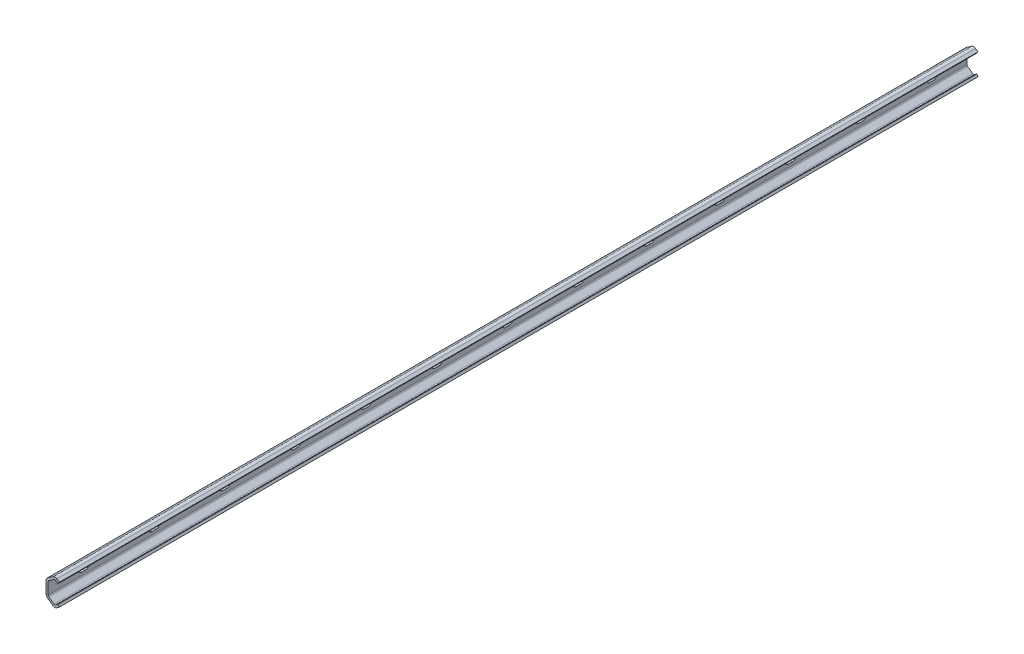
from build123d import *

# Parameters (mm, degrees)
EXTRUDE1_DEPTH  = 1040
EXTRUDE2_DEPTH  = 1041.181539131
LPATTERN1_COUNT = 13
LPATTERN1_PITCH = 80


with BuildPart() as part:
    # Sketch1 → Extrude1 (new body)
    with BuildSketch(Plane.XY):
        with BuildLine():
            Line((13.566058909, -10.161082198), (15, -12.208962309))
            Line((15, -12.208962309), (12.158978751, -14.198266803))
            ThreePointArc((12.158978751, -14.198266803), (10, -14.878990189), (7.841021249, -14.198266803))
            Line((7.841021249, -14.198266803), (2.07234263, -10.158994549))
            ThreePointArc((2.07234263, -10.158994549), (0.593144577, -8.506805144), (0, -6.37))
            Line((0, -6.37), (0, 6.37))
            ThreePointArc((0, 6.37), (0.551933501, 8.529345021), (2.07234263, 10.158994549))
            Line((2.07234263, 10.158994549), (7.841021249, 14.198266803))
            ThreePointArc((7.841021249, 14.198266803), (10, 14.878990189), (12.158978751, 14.198266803))
            Line((12.158978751, 14.198266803), (15, 12.208962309))
            Line((15, 12.208962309), (13.566058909, 10.161082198))
            Line((13.566058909, 10.161082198), (10.861016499, 12.055173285))
            ThreePointArc((10.861016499, 12.055173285), (10, 12.326650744), (9.138983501, 12.055173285))
            Line((9.138983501, 12.055173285), (3.254206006, 7.934607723))
            ThreePointArc((3.254206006, 7.934607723), (2.672861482, 7.25075677), (2.5, 6.37))
            Line((2.5, 6.37), (2.5, -6.37))
            ThreePointArc((2.5, -6.37), (2.698391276, -7.238450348), (3.254206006, -7.934607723))
            Line((3.254206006, -7.934607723), (9.138983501, -12.055173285))
            ThreePointArc((9.138983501, -12.055173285), (10, -12.326650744), (10.861016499, -12.055173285))
            Line((10.861016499, -12.055173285), (13.566058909, -10.161082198))
        make_face()
    extrude(amount=-EXTRUDE1_DEPTH)

    # Sketch3 → Extrude2 (cut, through all)
    with BuildSketch(Plane(origin=(2.5, 0, 0), x_dir=(0, 0, -1), z_dir=(1, 0, 0))):
        with BuildLine():
            Line((37.5, 3), (42.5, 3))
            ThreePointArc((42.5, 3), (45.5, 0), (42.5, -3))
            Line((42.5, -3), (37.5, -3))
            ThreePointArc((37.5, -3), (34.5, 0), (37.5, 3))
        make_face()
    extrude2 = extrude(amount=-EXTRUDE2_DEPTH, mode=Mode.SUBTRACT)

    # LPattern1: Extrude2 ×13
    with Locations(*[(0, 0, -i * LPATTERN1_PITCH) for i in range(1, LPATTERN1_COUNT)]):
        add(extrude2, mode=Mode.SUBTRACT)


solid = part.part
